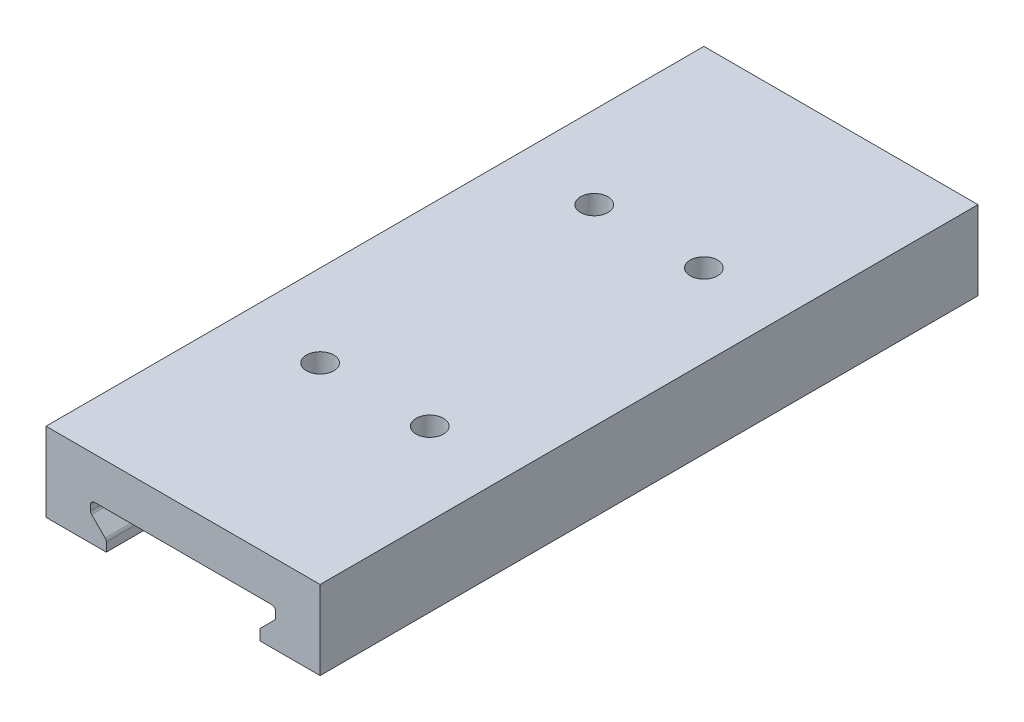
from build123d import *

# Parameters (mm, degrees)
SKETCH1_W             = 25
SKETCH1_H             = 7.2
EXTRUDE1_DEPTH        = 60
CUT_EXTRUDE1_DEPTH    = 62.945540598
FILLET1_R             = 0.35
FILLET1_OF_MIRROR1_R  = 0.35
M3X0_5_TAPPED_HOLE1_D = 2.5
LPATTERN2_COUNT       = 2
LPATTERN2_PITCH       = 25
LPATTERN2_COPY_1_D    = 2.5
SKETCH5_W             = 10.727969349
SKETCH5_H             = 0.05
CUT_EXTRUDE2_DEPTH    = 0.1


with BuildPart() as part:
    # Sketch1 → Extrude1 (new body)
    with BuildSketch(Plane.XY):
        with Locations((0, 5.4)):
            Rectangle(SKETCH1_W, SKETCH1_H)
    extrude(amount=EXTRUDE1_DEPTH)

    # Sketch2 → Cut-Extrude1 (cut, through all)
    with BuildSketch(Plane(origin=(0, 0, 0), x_dir=(-1, 0, 0), z_dir=(0, 0, -1))):
        Polygon((7, 5.2), (8.434167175, 5.2), (8.434167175, 4.2), (7, 2.765832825), (7, 0.776029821), (0, 0.776029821), (0, 5.2), align=None)
    cut_extrude1 = extrude(amount=-CUT_EXTRUDE1_DEPTH, mode=Mode.SUBTRACT)

    # Fillet1
    fillet1_edges = [part.edges().sort_by_distance(p)[0] for p in [
        (-7, 2.765832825, 30),
        (-8.434167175, 5.2, 30),
        (-8.434167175, 4.2, 30),
    ]]
    fillet(fillet1_edges, radius=FILLET1_R)

    # Mirror1: Cut-Extrude1 across plane
    add(cut_extrude1.mirror(Plane(origin=(0, 0, 0), x_dir=(0, 0, 1), z_dir=(1, 0, 0))), mode=Mode.SUBTRACT)

    # Fillet1 of Mirror1
    fillet1_of_mirror1_edges = [part.edges().sort_by_distance(p)[0] for p in [
        (7, 2.765832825, 30),
        (8.434167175, 5.2, 30),
        (8.434167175, 4.2, 30),
    ]]
    fillet(fillet1_of_mirror1_edges, radius=FILLET1_OF_MIRROR1_R)

    # M3x0.5 Tapped Hole1 (through all)
    with Locations(Plane(origin=(0, 9, 0), x_dir=(-1, 0, 0), z_dir=(0, 1, 0))):
        with Locations((5, 17.5)):
            m3x0_5_tapped_hole1 = Hole(M3X0_5_TAPPED_HOLE1_D / 2)

    # Mirror2: M3x0.5 Tapped Hole1 across plane
    add(m3x0_5_tapped_hole1.mirror(Plane(origin=(0, 0, 0), x_dir=(0, 0, 1), z_dir=(1, 0, 0))), mode=Mode.SUBTRACT)

    # LPattern2: M3x0.5 Tapped Hole1 ×2
    with Locations(*[(0, 0, i * LPATTERN2_PITCH) for i in range(1, LPATTERN2_COUNT)]):
        add(m3x0_5_tapped_hole1, mode=Mode.SUBTRACT)

    # LPattern2 copy 1 (through all)
    with Locations(Plane(origin=(0, 9, 25), x_dir=(1, 0, 0), z_dir=(0, 1, 0))):
        with Locations((5, -17.5)):
            Hole(LPATTERN2_COPY_1_D / 2)

    # Sketch5 → Cut-Extrude2 (cut)
    with BuildSketch(Plane.XZ.offset(-1.8)):
        with Locations((-9.989053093, 17.975)):
            Rectangle(SKETCH5_W, SKETCH5_H)
    cut_extrude2 = extrude(amount=-CUT_EXTRUDE2_DEPTH, mode=Mode.SUBTRACT)

    # Mirror3: Cut-Extrude2 across plane
    add(cut_extrude2.mirror(Plane.XY.offset(30)), mode=Mode.SUBTRACT)


solid = part.part
